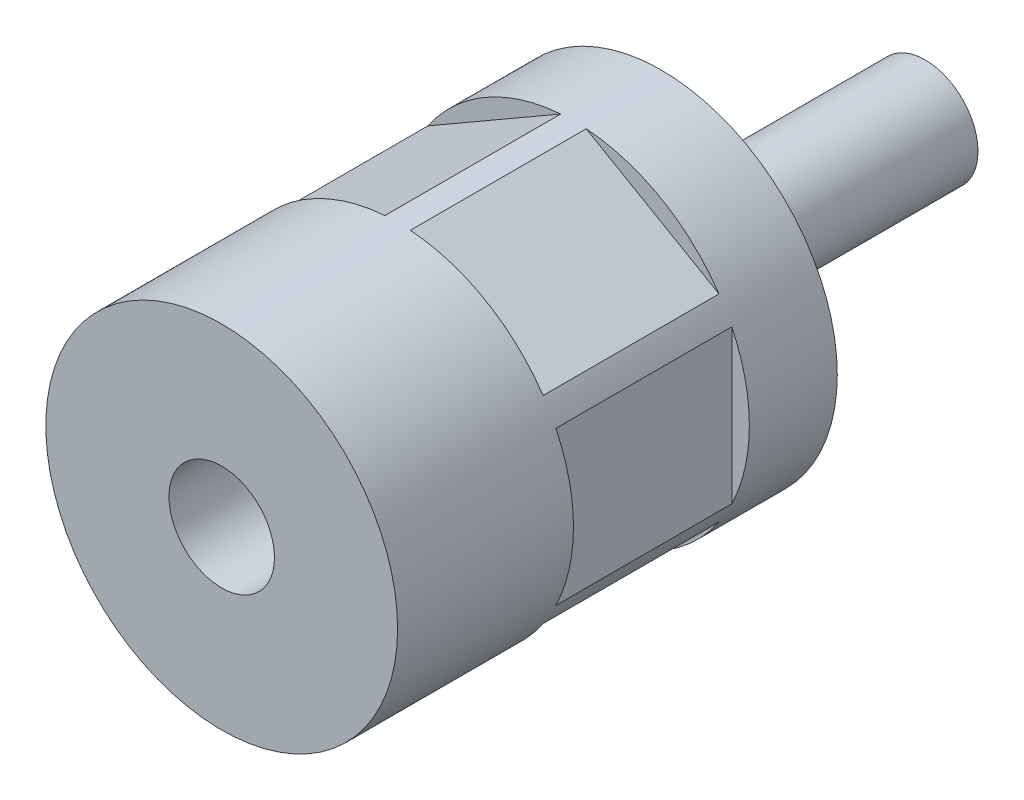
ISO-10303-21;
HEADER;
FILE_DESCRIPTION(('STEP AP214'),'2;1');
FILE_NAME('part.step','',(''),(''),'','','');
FILE_SCHEMA(('AUTOMOTIVE_DESIGN { 1 0 10303 214 1 1 1 1 }'));
ENDSEC;
DATA;
#1=APPLICATION_CONTEXT('core data for automotive mechanical design processes');
#2=APPLICATION_PROTOCOL_DEFINITION('international standard','automotive_design',2000,#1);
#3=PRODUCT_CONTEXT('',#1,'mechanical');
#4=PRODUCT('Part','Part','',(#3));
#5=PRODUCT_RELATED_PRODUCT_CATEGORY('part','',(#4));
#6=PRODUCT_DEFINITION_FORMATION('','',#4);
#7=PRODUCT_DEFINITION_CONTEXT('part definition',#1,'design');
#8=PRODUCT_DEFINITION('design','',#6,#7);
#9=PRODUCT_DEFINITION_SHAPE('','',#8);
#10=(LENGTH_UNIT() NAMED_UNIT(*) SI_UNIT(.MILLI.,.METRE.));
#11=(NAMED_UNIT(*) PLANE_ANGLE_UNIT() SI_UNIT($,.RADIAN.));
#12=(NAMED_UNIT(*) SI_UNIT($,.STERADIAN.) SOLID_ANGLE_UNIT());
#13=UNCERTAINTY_MEASURE_WITH_UNIT(LENGTH_MEASURE(1.E-05),#10,'distance_accuracy_value','');
#14=(GEOMETRIC_REPRESENTATION_CONTEXT(3) GLOBAL_UNCERTAINTY_ASSIGNED_CONTEXT((#13)) GLOBAL_UNIT_ASSIGNED_CONTEXT((#10,
#11,#12)) REPRESENTATION_CONTEXT('',''));
#15=CARTESIAN_POINT('',(0.,0.,0.));
#16=DIRECTION('',(0.,0.,1.));
#17=DIRECTION('',(1.,0.,0.));
#18=AXIS2_PLACEMENT_3D('',#15,#16,#17);
#19=CARTESIAN_POINT('',(0.,0.,80.));
#20=DIRECTION('',(0.,0.,1.));
#21=DIRECTION('',(1.,0.,0.));
#22=AXIS2_PLACEMENT_3D('',#19,#20,#21);
#23=CYLINDRICAL_SURFACE('',#22,20.);
#24=CARTESIAN_POINT('',(0.,0.,10.));
#25=DIRECTION('',(0.,0.,1.));
#26=DIRECTION('',(1.,0.,0.));
#27=AXIS2_PLACEMENT_3D('',#24,#25,#26);
#28=CIRCLE('',#27,20.);
#29=CARTESIAN_POINT('',(-16.5498344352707,-11.2295583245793,10.));
#30=VERTEX_POINT('',#29);
#31=CARTESIAN_POINT('',(-1.45016556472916,-19.9473562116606,10.));
#32=VERTEX_POINT('',#31);
#33=EDGE_CURVE('E152',#30,#32,#28,.T.);
#34=ORIENTED_EDGE('',*,*,#33,.F.);
#35=DIRECTION('',(0.,0.,1.));
#36=VECTOR('',#35,1.);
#37=CARTESIAN_POINT('',(-16.5498344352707,-11.2295583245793,80.));
#38=LINE('',#37,#36);
#39=CARTESIAN_POINT('',(-16.5498344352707,-11.2295583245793,30.));
#40=VERTEX_POINT('',#39);
#41=EDGE_CURVE('E9',#30,#40,#38,.T.);
#42=ORIENTED_EDGE('',*,*,#41,.T.);
#43=CARTESIAN_POINT('',(0.,0.,30.));
#44=DIRECTION('',(0.,0.,1.));
#45=DIRECTION('',(1.,0.,0.));
#46=AXIS2_PLACEMENT_3D('',#43,#44,#45);
#47=CIRCLE('',#46,20.);
#48=CARTESIAN_POINT('',(-1.45016556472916,-19.9473562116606,30.));
#49=VERTEX_POINT('',#48);
#50=EDGE_CURVE('E22',#40,#49,#47,.T.);
#51=ORIENTED_EDGE('',*,*,#50,.T.);
#52=DIRECTION('',(0.,0.,1.));
#53=VECTOR('',#52,1.);
#54=CARTESIAN_POINT('',(-1.45016556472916,-19.9473562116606,80.));
#55=LINE('',#54,#53);
#56=EDGE_CURVE('E149',#49,#32,#55,.F.);
#57=ORIENTED_EDGE('',*,*,#56,.T.);
#58=EDGE_LOOP('',(#34,#42,#51,#57));
#59=FACE_BOUND('',#58,.T.);
#60=DIRECTION('',(0.,0.,1.));
#61=VECTOR('',#60,1.);
#62=CARTESIAN_POINT('',(18.,8.71779788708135,80.));
#63=LINE('',#62,#61);
#64=CARTESIAN_POINT('',(18.,8.71779788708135,10.));
#65=VERTEX_POINT('',#64);
#66=CARTESIAN_POINT('',(18.,8.71779788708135,30.));
#67=VERTEX_POINT('',#66);
#68=EDGE_CURVE('E142',#65,#67,#63,.T.);
#69=ORIENTED_EDGE('',*,*,#68,.F.);
#70=CARTESIAN_POINT('',(18.,-8.71779788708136,10.));
#71=VERTEX_POINT('',#70);
#72=EDGE_CURVE('E141',#71,#65,#28,.T.);
#73=ORIENTED_EDGE('',*,*,#72,.F.);
#74=DIRECTION('',(0.,0.,1.));
#75=VECTOR('',#74,1.);
#76=CARTESIAN_POINT('',(18.,-8.71779788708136,80.));
#77=LINE('',#76,#75);
#78=CARTESIAN_POINT('',(18.,-8.71779788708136,30.));
#79=VERTEX_POINT('',#78);
#80=EDGE_CURVE('E138',#79,#71,#77,.F.);
#81=ORIENTED_EDGE('',*,*,#80,.F.);
#82=EDGE_CURVE('E145',#79,#67,#47,.T.);
#83=ORIENTED_EDGE('',*,*,#82,.T.);
#84=EDGE_LOOP('',(#69,#73,#81,#83));
#85=FACE_BOUND('',#84,.T.);
#86=CARTESIAN_POINT('',(16.5498344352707,11.2295583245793,10.));
#87=VERTEX_POINT('',#86);
#88=CARTESIAN_POINT('',(1.45016556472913,19.9473562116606,10.));
#89=VERTEX_POINT('',#88);
#90=EDGE_CURVE('E134',#87,#89,#28,.T.);
#91=ORIENTED_EDGE('',*,*,#90,.F.);
#92=DIRECTION('',(0.,0.,1.));
#93=VECTOR('',#92,1.);
#94=CARTESIAN_POINT('',(16.5498344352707,11.2295583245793,80.));
#95=LINE('',#94,#93);
#96=CARTESIAN_POINT('',(16.5498344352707,11.2295583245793,30.));
#97=VERTEX_POINT('',#96);
#98=EDGE_CURVE('E135',#87,#97,#95,.T.);
#99=ORIENTED_EDGE('',*,*,#98,.T.);
#100=CARTESIAN_POINT('',(1.45016556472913,19.9473562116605,30.));
#101=VERTEX_POINT('',#100);
#102=EDGE_CURVE('E139',#97,#101,#47,.T.);
#103=ORIENTED_EDGE('',*,*,#102,.T.);
#104=DIRECTION('',(0.,0.,1.));
#105=VECTOR('',#104,1.);
#106=CARTESIAN_POINT('',(1.45016556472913,19.9473562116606,80.));
#107=LINE('',#106,#105);
#108=EDGE_CURVE('E131',#101,#89,#107,.F.);
#109=ORIENTED_EDGE('',*,*,#108,.T.);
#110=EDGE_LOOP('',(#91,#99,#103,#109));
#111=FACE_BOUND('',#110,.T.);
#112=CARTESIAN_POINT('',(0.,0.,0.));
#113=DIRECTION('',(0.,0.,1.));
#114=DIRECTION('',(1.,0.,0.));
#115=AXIS2_PLACEMENT_3D('',#112,#113,#114);
#116=CIRCLE('',#115,20.);
#117=CARTESIAN_POINT('',(20.,0.,0.));
#118=VERTEX_POINT('',#117);
#119=EDGE_CURVE('E204',#118,#118,#116,.T.);
#120=ORIENTED_EDGE('',*,*,#119,.T.);
#121=EDGE_LOOP('',(#120));
#122=FACE_BOUND('',#121,.T.);
#123=CARTESIAN_POINT('',(0.,0.,50.));
#124=DIRECTION('',(0.,0.,1.));
#125=DIRECTION('',(1.,0.,0.));
#126=AXIS2_PLACEMENT_3D('',#123,#124,#125);
#127=CIRCLE('',#126,20.);
#128=CARTESIAN_POINT('',(20.,0.,50.));
#129=VERTEX_POINT('',#128);
#130=EDGE_CURVE('E201',#129,#129,#127,.T.);
#131=ORIENTED_EDGE('',*,*,#130,.F.);
#132=EDGE_LOOP('',(#131));
#133=FACE_BOUND('',#132,.T.);
#134=CARTESIAN_POINT('',(-18.,8.71779788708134,10.));
#135=VERTEX_POINT('',#134);
#136=CARTESIAN_POINT('',(-18.,-8.71779788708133,10.));
#137=VERTEX_POINT('',#136);
#138=EDGE_CURVE('E111',#135,#137,#28,.T.);
#139=ORIENTED_EDGE('',*,*,#138,.F.);
#140=DIRECTION('',(0.,0.,1.));
#141=VECTOR('',#140,1.);
#142=CARTESIAN_POINT('',(-18.,8.71779788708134,80.));
#143=LINE('',#142,#141);
#144=CARTESIAN_POINT('',(-18.,8.71779788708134,30.));
#145=VERTEX_POINT('',#144);
#146=EDGE_CURVE('E110',#135,#145,#143,.T.);
#147=ORIENTED_EDGE('',*,*,#146,.T.);
#148=CARTESIAN_POINT('',(-18.,-8.71779788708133,30.));
#149=VERTEX_POINT('',#148);
#150=EDGE_CURVE('E103',#145,#149,#47,.T.);
#151=ORIENTED_EDGE('',*,*,#150,.T.);
#152=DIRECTION('',(0.,0.,1.));
#153=VECTOR('',#152,1.);
#154=CARTESIAN_POINT('',(-18.,-8.71779788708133,80.));
#155=LINE('',#154,#153);
#156=EDGE_CURVE('E117',#149,#137,#155,.F.);
#157=ORIENTED_EDGE('',*,*,#156,.T.);
#158=EDGE_LOOP('',(#139,#147,#151,#157));
#159=FACE_BOUND('',#158,.T.);
#160=DIRECTION('',(0.,0.,1.));
#161=VECTOR('',#160,1.);
#162=CARTESIAN_POINT('',(-16.5498344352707,11.2295583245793,80.));
#163=LINE('',#162,#161);
#164=CARTESIAN_POINT('',(-16.5498344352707,11.2295583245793,10.));
#165=VERTEX_POINT('',#164);
#166=CARTESIAN_POINT('',(-16.5498344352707,11.2295583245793,30.));
#167=VERTEX_POINT('',#166);
#168=EDGE_CURVE('E129',#165,#167,#163,.T.);
#169=ORIENTED_EDGE('',*,*,#168,.F.);
#170=CARTESIAN_POINT('',(-1.45016556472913,19.9473562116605,10.));
#171=VERTEX_POINT('',#170);
#172=EDGE_CURVE('E125',#171,#165,#28,.T.);
#173=ORIENTED_EDGE('',*,*,#172,.F.);
#174=DIRECTION('',(0.,0.,1.));
#175=VECTOR('',#174,1.);
#176=CARTESIAN_POINT('',(-1.45016556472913,19.9473562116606,80.));
#177=LINE('',#176,#175);
#178=CARTESIAN_POINT('',(-1.45016556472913,19.9473562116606,30.));
#179=VERTEX_POINT('',#178);
#180=EDGE_CURVE('E123',#179,#171,#177,.F.);
#181=ORIENTED_EDGE('',*,*,#180,.F.);
#182=EDGE_CURVE('E113',#179,#167,#47,.T.);
#183=ORIENTED_EDGE('',*,*,#182,.T.);
#184=EDGE_LOOP('',(#169,#173,#181,#183));
#185=FACE_BOUND('',#184,.T.);
#186=DIRECTION('',(0.,0.,1.));
#187=VECTOR('',#186,1.);
#188=CARTESIAN_POINT('',(16.5498344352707,-11.2295583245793,80.));
#189=LINE('',#188,#187);
#190=CARTESIAN_POINT('',(16.5498344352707,-11.2295583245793,10.));
#191=VERTEX_POINT('',#190);
#192=CARTESIAN_POINT('',(16.5498344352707,-11.2295583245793,30.));
#193=VERTEX_POINT('',#192);
#194=EDGE_CURVE('E148',#191,#193,#189,.T.);
#195=ORIENTED_EDGE('',*,*,#194,.F.);
#196=CARTESIAN_POINT('',(1.45016556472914,-19.9473562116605,10.));
#197=VERTEX_POINT('',#196);
#198=EDGE_CURVE('E147',#197,#191,#28,.T.);
#199=ORIENTED_EDGE('',*,*,#198,.F.);
#200=DIRECTION('',(0.,0.,1.));
#201=VECTOR('',#200,1.);
#202=CARTESIAN_POINT('',(1.45016556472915,-19.9473562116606,80.));
#203=LINE('',#202,#201);
#204=CARTESIAN_POINT('',(1.45016556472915,-19.9473562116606,30.));
#205=VERTEX_POINT('',#204);
#206=EDGE_CURVE('E144',#205,#197,#203,.F.);
#207=ORIENTED_EDGE('',*,*,#206,.F.);
#208=EDGE_CURVE('E150',#205,#193,#47,.T.);
#209=ORIENTED_EDGE('',*,*,#208,.T.);
#210=EDGE_LOOP('',(#195,#199,#207,#209));
#211=FACE_BOUND('',#210,.T.);
#212=ADVANCED_FACE('F14',(#59,#85,#111,#122,#133,#159,#185,#211),#23,.T.);
#213=CARTESIAN_POINT('',(0.,0.,-30.));
#214=DIRECTION('',(0.,0.,1.));
#215=DIRECTION('',(1.,0.,0.));
#216=AXIS2_PLACEMENT_3D('',#213,#214,#215);
#217=PLANE('',#216);
#218=CARTESIAN_POINT('',(0.,0.,-30.));
#219=DIRECTION('',(0.,0.,1.));
#220=DIRECTION('',(1.,0.,0.));
#221=AXIS2_PLACEMENT_3D('',#218,#219,#220);
#222=CIRCLE('',#221,6.);
#223=CARTESIAN_POINT('',(6.,0.,-30.));
#224=VERTEX_POINT('',#223);
#225=EDGE_CURVE('E159',#224,#224,#222,.T.);
#226=ORIENTED_EDGE('',*,*,#225,.F.);
#227=EDGE_LOOP('',(#226));
#228=FACE_BOUND('',#227,.T.);
#229=ADVANCED_FACE('F16',(#228),#217,.F.);
#230=CARTESIAN_POINT('',(0.,0.,80.));
#231=DIRECTION('',(0.,0.,1.));
#232=DIRECTION('',(1.,0.,0.));
#233=AXIS2_PLACEMENT_3D('',#230,#231,#232);
#234=CYLINDRICAL_SURFACE('',#233,6.);
#235=CARTESIAN_POINT('',(0.,0.,-3.5));
#236=DIRECTION('',(0.,0.,1.));
#237=DIRECTION('',(1.,0.,0.));
#238=AXIS2_PLACEMENT_3D('',#235,#236,#237);
#239=CIRCLE('',#238,6.);
#240=CARTESIAN_POINT('',(6.,0.,-3.5));
#241=VERTEX_POINT('',#240);
#242=EDGE_CURVE('E213',#241,#241,#239,.T.);
#243=ORIENTED_EDGE('',*,*,#242,.F.);
#244=EDGE_LOOP('',(#243));
#245=FACE_BOUND('',#244,.T.);
#246=ORIENTED_EDGE('',*,*,#225,.T.);
#247=EDGE_LOOP('',(#246));
#248=FACE_BOUND('',#247,.T.);
#249=ADVANCED_FACE('F219',(#245,#248),#234,.T.);
#250=CARTESIAN_POINT('',(4.7,0.,-3.5));
#251=DIRECTION('',(0.,0.,1.));
#252=DIRECTION('',(1.,0.,0.));
#253=AXIS2_PLACEMENT_3D('',#250,#251,#252);
#254=PLANE('',#253);
#255=ORIENTED_EDGE('',*,*,#242,.T.);
#256=EDGE_LOOP('',(#255));
#257=FACE_BOUND('',#256,.T.);
#258=CARTESIAN_POINT('',(0.,0.,-3.5));
#259=DIRECTION('',(0.,0.,1.));
#260=DIRECTION('',(1.,0.,0.));
#261=AXIS2_PLACEMENT_3D('',#258,#259,#260);
#262=CIRCLE('',#261,4.7);
#263=CARTESIAN_POINT('',(4.7,0.,-3.5));
#264=VERTEX_POINT('',#263);
#265=EDGE_CURVE('E210',#264,#264,#262,.T.);
#266=ORIENTED_EDGE('',*,*,#265,.F.);
#267=EDGE_LOOP('',(#266));
#268=FACE_BOUND('',#267,.T.);
#269=ADVANCED_FACE('F227',(#257,#268),#254,.T.);
#270=CARTESIAN_POINT('',(0.,0.,80.));
#271=DIRECTION('',(0.,0.,1.));
#272=DIRECTION('',(1.,0.,0.));
#273=AXIS2_PLACEMENT_3D('',#270,#271,#272);
#274=CYLINDRICAL_SURFACE('',#273,4.7);
#275=ORIENTED_EDGE('',*,*,#265,.T.);
#276=EDGE_LOOP('',(#275));
#277=FACE_BOUND('',#276,.T.);
#278=CARTESIAN_POINT('',(0.,0.,0.));
#279=DIRECTION('',(0.,0.,1.));
#280=DIRECTION('',(1.,0.,0.));
#281=AXIS2_PLACEMENT_3D('',#278,#279,#280);
#282=CIRCLE('',#281,4.7);
#283=CARTESIAN_POINT('',(4.7,0.,0.));
#284=VERTEX_POINT('',#283);
#285=EDGE_CURVE('E207',#284,#284,#282,.T.);
#286=ORIENTED_EDGE('',*,*,#285,.F.);
#287=EDGE_LOOP('',(#286));
#288=FACE_BOUND('',#287,.T.);
#289=ADVANCED_FACE('F239',(#277,#288),#274,.T.);
#290=CARTESIAN_POINT('',(20.,0.,0.));
#291=DIRECTION('',(0.,0.,-1.));
#292=DIRECTION('',(-1.,0.,0.));
#293=AXIS2_PLACEMENT_3D('',#290,#291,#292);
#294=PLANE('',#293);
#295=ORIENTED_EDGE('',*,*,#285,.T.);
#296=EDGE_LOOP('',(#295));
#297=FACE_BOUND('',#296,.T.);
#298=ORIENTED_EDGE('',*,*,#119,.F.);
#299=EDGE_LOOP('',(#298));
#300=FACE_BOUND('',#299,.T.);
#301=ADVANCED_FACE('F236',(#297,#300),#294,.T.);
#302=CARTESIAN_POINT('',(20.,0.,50.));
#303=DIRECTION('',(0.,0.,-1.));
#304=DIRECTION('',(-1.,0.,0.));
#305=AXIS2_PLACEMENT_3D('',#302,#303,#304);
#306=PLANE('',#305);
#307=CARTESIAN_POINT('',(0.,0.,50.));
#308=DIRECTION('',(0.,0.,1.));
#309=DIRECTION('',(1.,0.,0.));
#310=AXIS2_PLACEMENT_3D('',#307,#308,#309);
#311=CIRCLE('',#310,6.);
#312=CARTESIAN_POINT('',(6.,0.,50.));
#313=VERTEX_POINT('',#312);
#314=EDGE_CURVE('E190',#313,#313,#311,.T.);
#315=ORIENTED_EDGE('',*,*,#314,.F.);
#316=EDGE_LOOP('',(#315));
#317=FACE_BOUND('',#316,.T.);
#318=ORIENTED_EDGE('',*,*,#130,.T.);
#319=EDGE_LOOP('',(#318));
#320=FACE_BOUND('',#319,.T.);
#321=ADVANCED_FACE('F234',(#317,#320),#306,.F.);
#322=CARTESIAN_POINT('',(0.,0.,80.));
#323=DIRECTION('',(0.,0.,1.));
#324=DIRECTION('',(1.,0.,0.));
#325=AXIS2_PLACEMENT_3D('',#322,#323,#324);
#326=CYLINDRICAL_SURFACE('',#325,6.);
#327=CARTESIAN_POINT('',(0.,0.,15.));
#328=DIRECTION('',(0.,0.,1.));
#329=DIRECTION('',(1.,0.,0.));
#330=AXIS2_PLACEMENT_3D('',#327,#328,#329);
#331=CIRCLE('',#330,6.);
#332=CARTESIAN_POINT('',(6.,0.,15.));
#333=VERTEX_POINT('',#332);
#334=EDGE_CURVE('E312',#333,#333,#331,.T.);
#335=ORIENTED_EDGE('',*,*,#334,.F.);
#336=EDGE_LOOP('',(#335));
#337=FACE_BOUND('',#336,.T.);
#338=ORIENTED_EDGE('',*,*,#314,.T.);
#339=EDGE_LOOP('',(#338));
#340=FACE_BOUND('',#339,.T.);
#341=ADVANCED_FACE('F260',(#337,#340),#326,.F.);
#342=CARTESIAN_POINT('',(-18.,10.3923048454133,30.));
#343=DIRECTION('',(1.,0.,0.));
#344=DIRECTION('',(0.,1.,0.));
#345=AXIS2_PLACEMENT_3D('',#342,#343,#344);
#346=PLANE('',#345);
#347=DIRECTION('',(0.,-1.,0.));
#348=VECTOR('',#347,1.);
#349=CARTESIAN_POINT('',(-18.,10.3923048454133,10.));
#350=LINE('',#349,#348);
#351=EDGE_CURVE('E313',#135,#137,#350,.T.);
#352=ORIENTED_EDGE('',*,*,#351,.T.);
#353=ORIENTED_EDGE('',*,*,#156,.F.);
#354=DIRECTION('',(0.,-1.,0.));
#355=VECTOR('',#354,1.);
#356=CARTESIAN_POINT('',(-18.,10.3923048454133,30.));
#357=LINE('',#356,#355);
#358=EDGE_CURVE('E106',#145,#149,#357,.T.);
#359=ORIENTED_EDGE('',*,*,#358,.F.);
#360=ORIENTED_EDGE('',*,*,#146,.F.);
#361=EDGE_LOOP('',(#352,#353,#359,#360));
#362=FACE_BOUND('',#361,.T.);
#363=ADVANCED_FACE('F115',(#362),#346,.F.);
#364=CARTESIAN_POINT('',(0.,0.,10.));
#365=DIRECTION('',(0.,0.,1.));
#366=DIRECTION('',(1.,0.,0.));
#367=AXIS2_PLACEMENT_3D('',#364,#365,#366);
#368=PLANE('',#367);
#369=ORIENTED_EDGE('',*,*,#138,.T.);
#370=ORIENTED_EDGE('',*,*,#351,.F.);
#371=EDGE_LOOP('',(#369,#370));
#372=FACE_BOUND('',#371,.T.);
#373=ADVANCED_FACE('F271',(#372),#368,.T.);
#374=CARTESIAN_POINT('',(0.,0.,30.));
#375=DIRECTION('',(0.,0.,1.));
#376=DIRECTION('',(1.,0.,0.));
#377=AXIS2_PLACEMENT_3D('',#374,#375,#376);
#378=PLANE('',#377);
#379=ORIENTED_EDGE('',*,*,#358,.T.);
#380=ORIENTED_EDGE('',*,*,#150,.F.);
#381=EDGE_LOOP('',(#379,#380));
#382=FACE_BOUND('',#381,.T.);
#383=ADVANCED_FACE('F105',(#382),#378,.F.);
#384=CARTESIAN_POINT('',(-18.,10.3923048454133,30.));
#385=DIRECTION('',(-0.5,0.866025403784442,0.));
#386=DIRECTION('',(-0.866025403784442,-0.5,0.));
#387=AXIS2_PLACEMENT_3D('',#384,#385,#386);
#388=PLANE('',#387);
#389=ORIENTED_EDGE('',*,*,#168,.T.);
#390=DIRECTION('',(0.866025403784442,0.5,0.));
#391=VECTOR('',#390,1.);
#392=CARTESIAN_POINT('',(-18.,10.3923048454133,30.));
#393=LINE('',#392,#391);
#394=EDGE_CURVE('E118',#167,#179,#393,.T.);
#395=ORIENTED_EDGE('',*,*,#394,.T.);
#396=ORIENTED_EDGE('',*,*,#180,.T.);
#397=DIRECTION('',(0.866025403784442,0.5,0.));
#398=VECTOR('',#397,1.);
#399=CARTESIAN_POINT('',(-18.,10.3923048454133,10.));
#400=LINE('',#399,#398);
#401=EDGE_CURVE('E315',#165,#171,#400,.T.);
#402=ORIENTED_EDGE('',*,*,#401,.F.);
#403=EDGE_LOOP('',(#389,#395,#396,#402));
#404=FACE_BOUND('',#403,.T.);
#405=ADVANCED_FACE('F298',(#404),#388,.T.);
#406=ORIENTED_EDGE('',*,*,#172,.T.);
#407=ORIENTED_EDGE('',*,*,#401,.T.);
#408=EDGE_LOOP('',(#406,#407));
#409=FACE_BOUND('',#408,.T.);
#410=ADVANCED_FACE('F286',(#409),#368,.T.);
#411=ORIENTED_EDGE('',*,*,#394,.F.);
#412=ORIENTED_EDGE('',*,*,#182,.F.);
#413=EDGE_LOOP('',(#411,#412));
#414=FACE_BOUND('',#413,.T.);
#415=ADVANCED_FACE('F281',(#414),#378,.F.);
#416=CARTESIAN_POINT('',(18.,10.3923048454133,30.));
#417=DIRECTION('',(-0.499999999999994,-0.866025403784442,0.));
#418=DIRECTION('',(0.866025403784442,-0.499999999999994,0.));
#419=AXIS2_PLACEMENT_3D('',#416,#417,#418);
#420=PLANE('',#419);
#421=DIRECTION('',(-0.866025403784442,0.499999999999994,0.));
#422=VECTOR('',#421,1.);
#423=CARTESIAN_POINT('',(18.,10.3923048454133,10.));
#424=LINE('',#423,#422);
#425=EDGE_CURVE('E323',#87,#89,#424,.T.);
#426=ORIENTED_EDGE('',*,*,#425,.T.);
#427=ORIENTED_EDGE('',*,*,#108,.F.);
#428=DIRECTION('',(-0.866025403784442,0.499999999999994,0.));
#429=VECTOR('',#428,1.);
#430=CARTESIAN_POINT('',(18.,10.3923048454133,30.));
#431=LINE('',#430,#429);
#432=EDGE_CURVE('E192',#97,#101,#431,.T.);
#433=ORIENTED_EDGE('',*,*,#432,.F.);
#434=ORIENTED_EDGE('',*,*,#98,.F.);
#435=EDGE_LOOP('',(#426,#427,#433,#434));
#436=FACE_BOUND('',#435,.T.);
#437=ADVANCED_FACE('F285',(#436),#420,.F.);
#438=ORIENTED_EDGE('',*,*,#90,.T.);
#439=ORIENTED_EDGE('',*,*,#425,.F.);
#440=EDGE_LOOP('',(#438,#439));
#441=FACE_BOUND('',#440,.T.);
#442=ADVANCED_FACE('F279',(#441),#368,.T.);
#443=ORIENTED_EDGE('',*,*,#432,.T.);
#444=ORIENTED_EDGE('',*,*,#102,.F.);
#445=EDGE_LOOP('',(#443,#444));
#446=FACE_BOUND('',#445,.T.);
#447=ADVANCED_FACE('F275',(#446),#378,.F.);
#448=CARTESIAN_POINT('',(18.,10.3923048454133,30.));
#449=DIRECTION('',(1.,0.,0.));
#450=DIRECTION('',(0.,1.,0.));
#451=AXIS2_PLACEMENT_3D('',#448,#449,#450);
#452=PLANE('',#451);
#453=ORIENTED_EDGE('',*,*,#68,.T.);
#454=DIRECTION('',(0.,-1.,0.));
#455=VECTOR('',#454,1.);
#456=CARTESIAN_POINT('',(18.,10.3923048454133,30.));
#457=LINE('',#456,#455);
#458=EDGE_CURVE('E187',#67,#79,#457,.T.);
#459=ORIENTED_EDGE('',*,*,#458,.T.);
#460=ORIENTED_EDGE('',*,*,#80,.T.);
#461=DIRECTION('',(0.,-1.,0.));
#462=VECTOR('',#461,1.);
#463=CARTESIAN_POINT('',(18.,10.3923048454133,10.));
#464=LINE('',#463,#462);
#465=EDGE_CURVE('E322',#65,#71,#464,.T.);
#466=ORIENTED_EDGE('',*,*,#465,.F.);
#467=EDGE_LOOP('',(#453,#459,#460,#466));
#468=FACE_BOUND('',#467,.T.);
#469=ADVANCED_FACE('F278',(#468),#452,.T.);
#470=ORIENTED_EDGE('',*,*,#72,.T.);
#471=ORIENTED_EDGE('',*,*,#465,.T.);
#472=EDGE_LOOP('',(#470,#471));
#473=FACE_BOUND('',#472,.T.);
#474=ADVANCED_FACE('F287',(#473),#368,.T.);
#475=ORIENTED_EDGE('',*,*,#458,.F.);
#476=ORIENTED_EDGE('',*,*,#82,.F.);
#477=EDGE_LOOP('',(#475,#476));
#478=FACE_BOUND('',#477,.T.);
#479=ADVANCED_FACE('F282',(#478),#378,.F.);
#480=CARTESIAN_POINT('',(18.,-10.3923048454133,30.));
#481=DIRECTION('',(0.5,-0.866025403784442,0.));
#482=DIRECTION('',(0.866025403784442,0.5,0.));
#483=AXIS2_PLACEMENT_3D('',#480,#481,#482);
#484=PLANE('',#483);
#485=ORIENTED_EDGE('',*,*,#194,.T.);
#486=DIRECTION('',(-0.866025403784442,-0.5,0.));
#487=VECTOR('',#486,1.);
#488=CARTESIAN_POINT('',(18.,-10.3923048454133,30.));
#489=LINE('',#488,#487);
#490=EDGE_CURVE('E37',#193,#205,#489,.T.);
#491=ORIENTED_EDGE('',*,*,#490,.T.);
#492=ORIENTED_EDGE('',*,*,#206,.T.);
#493=DIRECTION('',(-0.866025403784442,-0.5,0.));
#494=VECTOR('',#493,1.);
#495=CARTESIAN_POINT('',(18.,-10.3923048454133,10.));
#496=LINE('',#495,#494);
#497=EDGE_CURVE('E319',#191,#197,#496,.T.);
#498=ORIENTED_EDGE('',*,*,#497,.F.);
#499=EDGE_LOOP('',(#485,#491,#492,#498));
#500=FACE_BOUND('',#499,.T.);
#501=ADVANCED_FACE('F288',(#500),#484,.T.);
#502=ORIENTED_EDGE('',*,*,#198,.T.);
#503=ORIENTED_EDGE('',*,*,#497,.T.);
#504=EDGE_LOOP('',(#502,#503));
#505=FACE_BOUND('',#504,.T.);
#506=ADVANCED_FACE('F291',(#505),#368,.T.);
#507=ORIENTED_EDGE('',*,*,#490,.F.);
#508=ORIENTED_EDGE('',*,*,#208,.F.);
#509=EDGE_LOOP('',(#507,#508));
#510=FACE_BOUND('',#509,.T.);
#511=ADVANCED_FACE('F185',(#510),#378,.F.);
#512=DIRECTION('',(0.866025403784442,-0.5,0.));
#513=VECTOR('',#512,1.);
#514=CARTESIAN_POINT('',(-18.,-10.3923048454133,30.));
#515=LINE('',#514,#513);
#516=EDGE_CURVE('E186',#40,#49,#515,.T.);
#517=ORIENTED_EDGE('',*,*,#516,.T.);
#518=ORIENTED_EDGE('',*,*,#50,.F.);
#519=EDGE_LOOP('',(#517,#518));
#520=FACE_BOUND('',#519,.T.);
#521=ADVANCED_FACE('F335',(#520),#378,.F.);
#522=ORIENTED_EDGE('',*,*,#33,.T.);
#523=DIRECTION('',(0.866025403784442,-0.5,0.));
#524=VECTOR('',#523,1.);
#525=CARTESIAN_POINT('',(-18.,-10.3923048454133,10.));
#526=LINE('',#525,#524);
#527=EDGE_CURVE('E29',#30,#32,#526,.T.);
#528=ORIENTED_EDGE('',*,*,#527,.F.);
#529=EDGE_LOOP('',(#522,#528));
#530=FACE_BOUND('',#529,.T.);
#531=ADVANCED_FACE('F306',(#530),#368,.T.);
#532=CARTESIAN_POINT('',(-18.,-10.3923048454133,30.));
#533=DIRECTION('',(0.5,0.866025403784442,0.));
#534=DIRECTION('',(-0.866025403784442,0.5,0.));
#535=AXIS2_PLACEMENT_3D('',#532,#533,#534);
#536=PLANE('',#535);
#537=ORIENTED_EDGE('',*,*,#527,.T.);
#538=ORIENTED_EDGE('',*,*,#56,.F.);
#539=ORIENTED_EDGE('',*,*,#516,.F.);
#540=ORIENTED_EDGE('',*,*,#41,.F.);
#541=EDGE_LOOP('',(#537,#538,#539,#540));
#542=FACE_BOUND('',#541,.T.);
#543=ADVANCED_FACE('F302',(#542),#536,.F.);
#544=CARTESIAN_POINT('',(0.,0.,15.));
#545=DIRECTION('',(0.,0.,1.));
#546=DIRECTION('',(1.,0.,0.));
#547=AXIS2_PLACEMENT_3D('',#544,#545,#546);
#548=PLANE('',#547);
#549=ORIENTED_EDGE('',*,*,#334,.T.);
#550=EDGE_LOOP('',(#549));
#551=FACE_BOUND('',#550,.T.);
#552=ADVANCED_FACE('F305',(#551),#548,.T.);
#553=CLOSED_SHELL('',(#212,#229,#249,#269,#289,#301,#321,#341,#363,#373,#383,#405,#410,#415,
#437,#442,#447,#469,#474,#479,#501,#506,#511,#521,#531,#543,#552));
#554=MANIFOLD_SOLID_BREP('B1',#553);
#555=ADVANCED_BREP_SHAPE_REPRESENTATION('',(#18,#554),#14);
#556=SHAPE_DEFINITION_REPRESENTATION(#9,#555);
ENDSEC;
END-ISO-10303-21;
